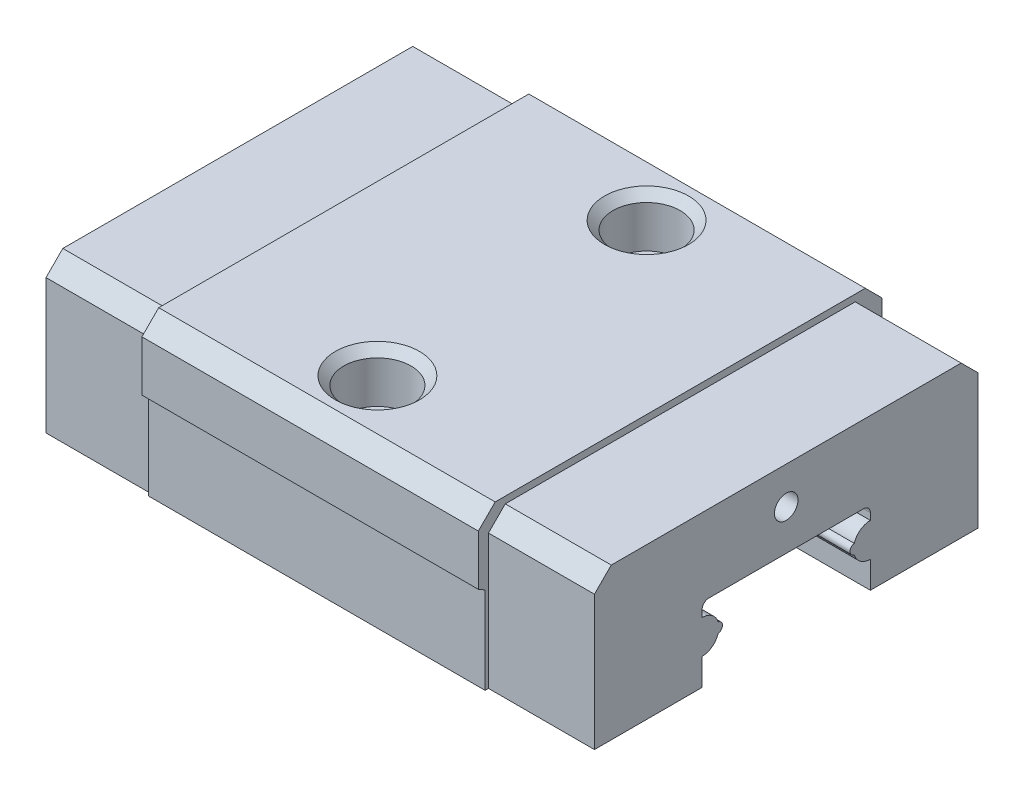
ISO-10303-21;
HEADER;
FILE_DESCRIPTION(('STEP AP214'),'2;1');
FILE_NAME('part.step','',(''),(''),'','','');
FILE_SCHEMA(('AUTOMOTIVE_DESIGN { 1 0 10303 214 1 1 1 1 }'));
ENDSEC;
DATA;
#1=APPLICATION_CONTEXT('core data for automotive mechanical design processes');
#2=APPLICATION_PROTOCOL_DEFINITION('international standard','automotive_design',2000,#1);
#3=PRODUCT_CONTEXT('',#1,'mechanical');
#4=PRODUCT('Part','Part','',(#3));
#5=PRODUCT_RELATED_PRODUCT_CATEGORY('part','',(#4));
#6=PRODUCT_DEFINITION_FORMATION('','',#4);
#7=PRODUCT_DEFINITION_CONTEXT('part definition',#1,'design');
#8=PRODUCT_DEFINITION('design','',#6,#7);
#9=PRODUCT_DEFINITION_SHAPE('','',#8);
#10=(LENGTH_UNIT() NAMED_UNIT(*) SI_UNIT(.MILLI.,.METRE.));
#11=(NAMED_UNIT(*) PLANE_ANGLE_UNIT() SI_UNIT($,.RADIAN.));
#12=(NAMED_UNIT(*) SI_UNIT($,.STERADIAN.) SOLID_ANGLE_UNIT());
#13=UNCERTAINTY_MEASURE_WITH_UNIT(LENGTH_MEASURE(1.E-05),#10,'distance_accuracy_value','');
#14=(GEOMETRIC_REPRESENTATION_CONTEXT(3) GLOBAL_UNCERTAINTY_ASSIGNED_CONTEXT((#13)) GLOBAL_UNIT_ASSIGNED_CONTEXT((#10,
#11,#12)) REPRESENTATION_CONTEXT('',''));
#15=CARTESIAN_POINT('',(0.,0.,0.));
#16=DIRECTION('',(0.,0.,1.));
#17=DIRECTION('',(1.,0.,0.));
#18=AXIS2_PLACEMENT_3D('',#15,#16,#17);
#19=CARTESIAN_POINT('',(-25.,3.5,2.5));
#20=DIRECTION('',(0.,0.,1.));
#21=DIRECTION('',(0.,-1.,0.));
#22=AXIS2_PLACEMENT_3D('',#19,#20,#21);
#23=PLANE('',#22);
#24=DIRECTION('',(0.,1.,0.));
#25=VECTOR('',#24,1.);
#26=CARTESIAN_POINT('',(-23.15,0.499999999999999,2.5));
#27=LINE('',#26,#25);
#28=CARTESIAN_POINT('',(-23.15,1.3,2.5));
#29=VERTEX_POINT('',#28);
#30=CARTESIAN_POINT('',(-23.15,2.09999999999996,2.5));
#31=VERTEX_POINT('',#30);
#32=EDGE_CURVE('E473',#29,#31,#27,.T.);
#33=ORIENTED_EDGE('',*,*,#32,.T.);
#34=DIRECTION('',(1.,0.,0.));
#35=VECTOR('',#34,1.);
#36=CARTESIAN_POINT('',(-23.15,2.09999999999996,2.5));
#37=LINE('',#36,#35);
#38=CARTESIAN_POINT('',(-6.85,2.09999999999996,2.5));
#39=VERTEX_POINT('',#38);
#40=EDGE_CURVE('E286',#31,#39,#37,.T.);
#41=ORIENTED_EDGE('',*,*,#40,.T.);
#42=DIRECTION('',(0.,-1.,0.));
#43=VECTOR('',#42,1.);
#44=CARTESIAN_POINT('',(-6.85,0.499999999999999,2.5));
#45=LINE('',#44,#43);
#46=CARTESIAN_POINT('',(-6.85,1.3,2.5));
#47=VERTEX_POINT('',#46);
#48=EDGE_CURVE('E418',#39,#47,#45,.T.);
#49=ORIENTED_EDGE('',*,*,#48,.T.);
#50=DIRECTION('',(1.,0.,0.));
#51=VECTOR('',#50,1.);
#52=CARTESIAN_POINT('',(-25.,1.3,2.5));
#53=LINE('',#52,#51);
#54=EDGE_CURVE('E539',#29,#47,#53,.T.);
#55=ORIENTED_EDGE('',*,*,#54,.F.);
#56=EDGE_LOOP('',(#33,#41,#49,#55));
#57=FACE_BOUND('',#56,.T.);
#58=ADVANCED_FACE('F39',(#57),#23,.F.);
#59=CARTESIAN_POINT('',(-25.,0.5,-2.5));
#60=DIRECTION('',(0.,0.,-1.));
#61=DIRECTION('',(0.,1.,0.));
#62=AXIS2_PLACEMENT_3D('',#59,#60,#61);
#63=PLANE('',#62);
#64=DIRECTION('',(0.,1.,0.));
#65=VECTOR('',#64,1.);
#66=CARTESIAN_POINT('',(-6.85,0.5,-2.5));
#67=LINE('',#66,#65);
#68=CARTESIAN_POINT('',(-6.85,3.09999999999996,-2.5));
#69=VERTEX_POINT('',#68);
#70=CARTESIAN_POINT('',(-6.85,3.3,-2.5));
#71=VERTEX_POINT('',#70);
#72=EDGE_CURVE('E415',#69,#71,#67,.T.);
#73=ORIENTED_EDGE('',*,*,#72,.T.);
#74=DIRECTION('',(1.,0.,0.));
#75=VECTOR('',#74,1.);
#76=CARTESIAN_POINT('',(-23.15,3.3,-2.5));
#77=LINE('',#76,#75);
#78=CARTESIAN_POINT('',(-23.15,3.3,-2.5));
#79=VERTEX_POINT('',#78);
#80=EDGE_CURVE('E578',#71,#79,#77,.F.);
#81=ORIENTED_EDGE('',*,*,#80,.T.);
#82=DIRECTION('',(0.,-1.,0.));
#83=VECTOR('',#82,1.);
#84=CARTESIAN_POINT('',(-23.15,0.5,-2.5));
#85=LINE('',#84,#83);
#86=CARTESIAN_POINT('',(-23.15,3.09999999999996,-2.5));
#87=VERTEX_POINT('',#86);
#88=EDGE_CURVE('E563',#79,#87,#85,.T.);
#89=ORIENTED_EDGE('',*,*,#88,.T.);
#90=DIRECTION('',(1.,0.,0.));
#91=VECTOR('',#90,1.);
#92=CARTESIAN_POINT('',(-23.15,3.09999999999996,-2.5));
#93=LINE('',#92,#91);
#94=EDGE_CURVE('E567',#87,#69,#93,.T.);
#95=ORIENTED_EDGE('',*,*,#94,.T.);
#96=EDGE_LOOP('',(#73,#81,#89,#95));
#97=FACE_BOUND('',#96,.T.);
#98=ADVANCED_FACE('F665',(#97),#63,.F.);
#99=CARTESIAN_POINT('',(-6.85,5.8,-5.7));
#100=DIRECTION('',(-1.,0.,0.));
#101=DIRECTION('',(0.,0.,-1.));
#102=AXIS2_PLACEMENT_3D('',#99,#100,#101);
#103=PLANE('',#102);
#104=ORIENTED_EDGE('',*,*,#48,.F.);
#105=CARTESIAN_POINT('',(-6.85,2.59999999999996,2.5));
#106=DIRECTION('',(1.,0.,0.));
#107=DIRECTION('',(0.,0.,1.));
#108=AXIS2_PLACEMENT_3D('',#105,#106,#107);
#109=CIRCLE('',#108,0.5);
#110=CARTESIAN_POINT('',(-6.85,2.45174744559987,2.02248436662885));
#111=VERTEX_POINT('',#110);
#112=EDGE_CURVE('E307',#39,#111,#109,.T.);
#113=ORIENTED_EDGE('',*,*,#112,.T.);
#114=CARTESIAN_POINT('',(-6.85,2.59999999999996,2.04531373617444));
#115=DIRECTION('',(1.,0.,0.));
#116=DIRECTION('',(0.,0.,1.));
#117=AXIS2_PLACEMENT_3D('',#114,#115,#116);
#118=CIRCLE('',#117,0.15);
#119=CARTESIAN_POINT('',(-6.85,2.74825255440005,2.02248436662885));
#120=VERTEX_POINT('',#119);
#121=EDGE_CURVE('E290',#111,#120,#118,.T.);
#122=ORIENTED_EDGE('',*,*,#121,.T.);
#123=CARTESIAN_POINT('',(-6.85,3.09999999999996,2.5));
#124=VERTEX_POINT('',#123);
#125=EDGE_CURVE('E304',#120,#124,#109,.T.);
#126=ORIENTED_EDGE('',*,*,#125,.T.);
#127=CARTESIAN_POINT('',(-6.85,3.3,2.5));
#128=VERTEX_POINT('',#127);
#129=EDGE_CURVE('E419',#128,#124,#45,.T.);
#130=ORIENTED_EDGE('',*,*,#129,.F.);
#131=CARTESIAN_POINT('',(-6.85,3.3,2.3));
#132=DIRECTION('',(-1.,0.,0.));
#133=DIRECTION('',(0.,0.,1.));
#134=AXIS2_PLACEMENT_3D('',#131,#132,#133);
#135=CIRCLE('',#134,0.2);
#136=CARTESIAN_POINT('',(-6.85,3.5,2.3));
#137=VERTEX_POINT('',#136);
#138=EDGE_CURVE('E47',#128,#137,#135,.T.);
#139=ORIENTED_EDGE('',*,*,#138,.T.);
#140=DIRECTION('',(0.,0.,1.));
#141=VECTOR('',#140,1.);
#142=CARTESIAN_POINT('',(-6.85,3.5,-2.5));
#143=LINE('',#142,#141);
#144=CARTESIAN_POINT('',(-6.85,3.5,-2.3));
#145=VERTEX_POINT('',#144);
#146=EDGE_CURVE('E412',#145,#137,#143,.T.);
#147=ORIENTED_EDGE('',*,*,#146,.F.);
#148=CARTESIAN_POINT('',(-6.85,3.3,-2.3));
#149=DIRECTION('',(-1.,0.,0.));
#150=DIRECTION('',(0.,0.,1.));
#151=AXIS2_PLACEMENT_3D('',#148,#149,#150);
#152=CIRCLE('',#151,0.2);
#153=EDGE_CURVE('E582',#145,#71,#152,.T.);
#154=ORIENTED_EDGE('',*,*,#153,.T.);
#155=ORIENTED_EDGE('',*,*,#72,.F.);
#156=CARTESIAN_POINT('',(-6.85,2.59999999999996,-2.5));
#157=DIRECTION('',(1.,0.,0.));
#158=DIRECTION('',(0.,0.,-1.));
#159=AXIS2_PLACEMENT_3D('',#156,#157,#158);
#160=CIRCLE('',#159,0.5);
#161=CARTESIAN_POINT('',(-6.85,2.74825255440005,-2.02248436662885));
#162=VERTEX_POINT('',#161);
#163=EDGE_CURVE('E309',#69,#162,#160,.T.);
#164=ORIENTED_EDGE('',*,*,#163,.T.);
#165=CARTESIAN_POINT('',(-6.85,2.59999999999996,-2.04531373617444));
#166=DIRECTION('',(1.,0.,0.));
#167=DIRECTION('',(0.,0.,-1.));
#168=AXIS2_PLACEMENT_3D('',#165,#166,#167);
#169=CIRCLE('',#168,0.15);
#170=CARTESIAN_POINT('',(-6.85,2.45174744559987,-2.02248436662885));
#171=VERTEX_POINT('',#170);
#172=EDGE_CURVE('E322',#162,#171,#169,.T.);
#173=ORIENTED_EDGE('',*,*,#172,.T.);
#174=CARTESIAN_POINT('',(-6.85,2.09999999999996,-2.5));
#175=VERTEX_POINT('',#174);
#176=EDGE_CURVE('E319',#171,#175,#160,.T.);
#177=ORIENTED_EDGE('',*,*,#176,.T.);
#178=CARTESIAN_POINT('',(-6.85,1.3,-2.5));
#179=VERTEX_POINT('',#178);
#180=EDGE_CURVE('E416',#179,#175,#67,.T.);
#181=ORIENTED_EDGE('',*,*,#180,.F.);
#182=DIRECTION('',(0.,0.,1.));
#183=VECTOR('',#182,1.);
#184=CARTESIAN_POINT('',(-6.85,1.3,-5.7));
#185=LINE('',#184,#183);
#186=CARTESIAN_POINT('',(-6.85,1.3,-5.7));
#187=VERTEX_POINT('',#186);
#188=EDGE_CURVE('E383',#187,#179,#185,.T.);
#189=ORIENTED_EDGE('',*,*,#188,.F.);
#190=DIRECTION('',(0.,-1.,0.));
#191=VECTOR('',#190,1.);
#192=CARTESIAN_POINT('',(-6.85,1.3,-5.7));
#193=LINE('',#192,#191);
#194=CARTESIAN_POINT('',(-6.85,5.3,-5.7));
#195=VERTEX_POINT('',#194);
#196=EDGE_CURVE('E366',#195,#187,#193,.T.);
#197=ORIENTED_EDGE('',*,*,#196,.F.);
#198=DIRECTION('',(0.,-0.707106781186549,-0.707106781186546));
#199=VECTOR('',#198,1.);
#200=CARTESIAN_POINT('',(-6.85,5.8,-5.2));
#201=LINE('',#200,#199);
#202=CARTESIAN_POINT('',(-6.85,5.8,-5.2));
#203=VERTEX_POINT('',#202);
#204=EDGE_CURVE('E369',#203,#195,#201,.T.);
#205=ORIENTED_EDGE('',*,*,#204,.F.);
#206=DIRECTION('',(0.,0.,-1.));
#207=VECTOR('',#206,1.);
#208=CARTESIAN_POINT('',(-6.85,5.8,-5.2));
#209=LINE('',#208,#207);
#210=CARTESIAN_POINT('',(-6.85,5.8,5.2));
#211=VERTEX_POINT('',#210);
#212=EDGE_CURVE('E373',#211,#203,#209,.T.);
#213=ORIENTED_EDGE('',*,*,#212,.F.);
#214=DIRECTION('',(0.,0.707106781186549,-0.707106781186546));
#215=VECTOR('',#214,1.);
#216=CARTESIAN_POINT('',(-6.85,5.8,5.2));
#217=LINE('',#216,#215);
#218=CARTESIAN_POINT('',(-6.85,5.3,5.7));
#219=VERTEX_POINT('',#218);
#220=EDGE_CURVE('E376',#219,#211,#217,.T.);
#221=ORIENTED_EDGE('',*,*,#220,.F.);
#222=DIRECTION('',(0.,1.,0.));
#223=VECTOR('',#222,1.);
#224=CARTESIAN_POINT('',(-6.85,1.3,5.7));
#225=LINE('',#224,#223);
#226=CARTESIAN_POINT('',(-6.85,1.3,5.7));
#227=VERTEX_POINT('',#226);
#228=EDGE_CURVE('E379',#227,#219,#225,.T.);
#229=ORIENTED_EDGE('',*,*,#228,.F.);
#230=EDGE_CURVE('E382',#47,#227,#185,.T.);
#231=ORIENTED_EDGE('',*,*,#230,.F.);
#232=EDGE_LOOP('',(#104,#113,#122,#126,#130,#139,#147,#154,#155,#164,#173,#177,#181,#189,#197,
#205,#213,#221,#229,#231));
#233=FACE_BOUND('',#232,.T.);
#234=CARTESIAN_POINT('',(-6.85,4.7,0.));
#235=DIRECTION('',(-1.,0.,0.));
#236=DIRECTION('',(0.,0.,1.));
#237=AXIS2_PLACEMENT_3D('',#234,#235,#236);
#238=CIRCLE('',#237,0.35);
#239=CARTESIAN_POINT('',(-6.85,4.7,0.35));
#240=VERTEX_POINT('',#239);
#241=EDGE_CURVE('E359',#240,#240,#238,.T.);
#242=ORIENTED_EDGE('',*,*,#241,.T.);
#243=EDGE_LOOP('',(#242));
#244=FACE_BOUND('',#243,.T.);
#245=ADVANCED_FACE('F588',(#233,#244),#103,.F.);
#246=CARTESIAN_POINT('',(-20.,1.3,-5.8));
#247=DIRECTION('',(-1.,0.,0.));
#248=DIRECTION('',(0.,0.,1.));
#249=AXIS2_PLACEMENT_3D('',#246,#247,#248);
#250=PLANE('',#249);
#251=DIRECTION('',(0.,0.,-1.));
#252=VECTOR('',#251,1.);
#253=CARTESIAN_POINT('',(-20.,1.3,5.8));
#254=LINE('',#253,#252);
#255=CARTESIAN_POINT('',(-20.,1.3,-5.7));
#256=VERTEX_POINT('',#255);
#257=CARTESIAN_POINT('',(-20.,1.3,-5.8));
#258=VERTEX_POINT('',#257);
#259=EDGE_CURVE('E531',#256,#258,#254,.T.);
#260=ORIENTED_EDGE('',*,*,#259,.F.);
#261=DIRECTION('',(0.,-1.,0.));
#262=VECTOR('',#261,1.);
#263=CARTESIAN_POINT('',(-20.,1.3,-5.7));
#264=LINE('',#263,#262);
#265=CARTESIAN_POINT('',(-20.,5.3,-5.7));
#266=VERTEX_POINT('',#265);
#267=EDGE_CURVE('E425',#266,#256,#264,.T.);
#268=ORIENTED_EDGE('',*,*,#267,.F.);
#269=DIRECTION('',(0.,-0.707106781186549,-0.707106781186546));
#270=VECTOR('',#269,1.);
#271=CARTESIAN_POINT('',(-20.,5.8,-5.2));
#272=LINE('',#271,#270);
#273=CARTESIAN_POINT('',(-20.,5.8,-5.2));
#274=VERTEX_POINT('',#273);
#275=EDGE_CURVE('E432',#274,#266,#272,.T.);
#276=ORIENTED_EDGE('',*,*,#275,.F.);
#277=DIRECTION('',(0.,0.,-1.));
#278=VECTOR('',#277,1.);
#279=CARTESIAN_POINT('',(-20.,5.8,-5.2));
#280=LINE('',#279,#278);
#281=CARTESIAN_POINT('',(-20.,5.8,5.2));
#282=VERTEX_POINT('',#281);
#283=EDGE_CURVE('E451',#282,#274,#280,.T.);
#284=ORIENTED_EDGE('',*,*,#283,.F.);
#285=DIRECTION('',(0.,0.707106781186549,-0.707106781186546));
#286=VECTOR('',#285,1.);
#287=CARTESIAN_POINT('',(-20.,5.8,5.2));
#288=LINE('',#287,#286);
#289=CARTESIAN_POINT('',(-20.,5.3,5.7));
#290=VERTEX_POINT('',#289);
#291=EDGE_CURVE('E449',#290,#282,#288,.T.);
#292=ORIENTED_EDGE('',*,*,#291,.F.);
#293=DIRECTION('',(0.,1.,0.));
#294=VECTOR('',#293,1.);
#295=CARTESIAN_POINT('',(-20.,1.3,5.7));
#296=LINE('',#295,#294);
#297=CARTESIAN_POINT('',(-20.,1.3,5.7));
#298=VERTEX_POINT('',#297);
#299=EDGE_CURVE('E447',#298,#290,#296,.T.);
#300=ORIENTED_EDGE('',*,*,#299,.F.);
#301=CARTESIAN_POINT('',(-20.,1.3,5.8));
#302=VERTEX_POINT('',#301);
#303=EDGE_CURVE('E532',#302,#298,#254,.T.);
#304=ORIENTED_EDGE('',*,*,#303,.F.);
#305=DIRECTION('',(0.,-1.,0.));
#306=VECTOR('',#305,1.);
#307=CARTESIAN_POINT('',(-20.,1.3,5.8));
#308=LINE('',#307,#306);
#309=CARTESIAN_POINT('',(-20.,3.88452994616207,5.8));
#310=VERTEX_POINT('',#309);
#311=EDGE_CURVE('E528',#310,#302,#308,.T.);
#312=ORIENTED_EDGE('',*,*,#311,.F.);
#313=DIRECTION('',(0.,-0.500000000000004,-0.866025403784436));
#314=VECTOR('',#313,1.);
#315=CARTESIAN_POINT('',(-20.,4.,6.));
#316=LINE('',#315,#314);
#317=CARTESIAN_POINT('',(-20.,4.,6.));
#318=VERTEX_POINT('',#317);
#319=EDGE_CURVE('E525',#318,#310,#316,.T.);
#320=ORIENTED_EDGE('',*,*,#319,.F.);
#321=DIRECTION('',(0.,-1.,0.));
#322=VECTOR('',#321,1.);
#323=CARTESIAN_POINT('',(-20.,5.50000000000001,6.));
#324=LINE('',#323,#322);
#325=CARTESIAN_POINT('',(-20.,5.50000000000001,6.));
#326=VERTEX_POINT('',#325);
#327=EDGE_CURVE('E522',#326,#318,#324,.T.);
#328=ORIENTED_EDGE('',*,*,#327,.F.);
#329=DIRECTION('',(0.,-0.707106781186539,0.707106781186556));
#330=VECTOR('',#329,1.);
#331=CARTESIAN_POINT('',(-20.,6.,5.5));
#332=LINE('',#331,#330);
#333=CARTESIAN_POINT('',(-20.,6.,5.5));
#334=VERTEX_POINT('',#333);
#335=EDGE_CURVE('E519',#334,#326,#332,.T.);
#336=ORIENTED_EDGE('',*,*,#335,.F.);
#337=DIRECTION('',(0.,0.,1.));
#338=VECTOR('',#337,1.);
#339=CARTESIAN_POINT('',(-20.,6.,2.5));
#340=LINE('',#339,#338);
#341=CARTESIAN_POINT('',(-20.,6.,-5.5));
#342=VERTEX_POINT('',#341);
#343=EDGE_CURVE('E517',#342,#334,#340,.T.);
#344=ORIENTED_EDGE('',*,*,#343,.F.);
#345=DIRECTION('',(0.,0.707106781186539,0.707106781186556));
#346=VECTOR('',#345,1.);
#347=CARTESIAN_POINT('',(-20.,6.,-5.5));
#348=LINE('',#347,#346);
#349=CARTESIAN_POINT('',(-20.,5.50000000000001,-6.));
#350=VERTEX_POINT('',#349);
#351=EDGE_CURVE('E514',#350,#342,#348,.T.);
#352=ORIENTED_EDGE('',*,*,#351,.F.);
#353=DIRECTION('',(0.,1.,0.));
#354=VECTOR('',#353,1.);
#355=CARTESIAN_POINT('',(-20.,5.50000000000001,-6.));
#356=LINE('',#355,#354);
#357=CARTESIAN_POINT('',(-20.,4.,-6.));
#358=VERTEX_POINT('',#357);
#359=EDGE_CURVE('E511',#358,#350,#356,.T.);
#360=ORIENTED_EDGE('',*,*,#359,.F.);
#361=DIRECTION('',(0.,0.500000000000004,-0.866025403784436));
#362=VECTOR('',#361,1.);
#363=CARTESIAN_POINT('',(-20.,4.,-6.));
#364=LINE('',#363,#362);
#365=CARTESIAN_POINT('',(-20.,3.88452994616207,-5.8));
#366=VERTEX_POINT('',#365);
#367=EDGE_CURVE('E508',#366,#358,#364,.T.);
#368=ORIENTED_EDGE('',*,*,#367,.F.);
#369=DIRECTION('',(0.,1.,0.));
#370=VECTOR('',#369,1.);
#371=CARTESIAN_POINT('',(-20.,1.3,-5.8));
#372=LINE('',#371,#370);
#373=EDGE_CURVE('E505',#258,#366,#372,.T.);
#374=ORIENTED_EDGE('',*,*,#373,.F.);
#375=EDGE_LOOP('',(#260,#268,#276,#284,#292,#300,#304,#312,#320,#328,#336,#344,#352,#360,#368,#374));
#376=FACE_BOUND('',#375,.T.);
#377=ADVANCED_FACE('F672',(#376),#250,.T.);
#378=CARTESIAN_POINT('',(-20.,1.3,5.8));
#379=DIRECTION('',(0.,-1.,0.));
#380=DIRECTION('',(0.,0.,-1.));
#381=AXIS2_PLACEMENT_3D('',#378,#379,#380);
#382=PLANE('',#381);
#383=ORIENTED_EDGE('',*,*,#303,.T.);
#384=DIRECTION('',(1.,0.,0.));
#385=VECTOR('',#384,1.);
#386=CARTESIAN_POINT('',(-23.15,1.3,5.7));
#387=LINE('',#386,#385);
#388=CARTESIAN_POINT('',(-23.15,1.3,5.7));
#389=VERTEX_POINT('',#388);
#390=EDGE_CURVE('E465',#389,#298,#387,.T.);
#391=ORIENTED_EDGE('',*,*,#390,.F.);
#392=DIRECTION('',(0.,0.,1.));
#393=VECTOR('',#392,1.);
#394=CARTESIAN_POINT('',(-23.15,1.3,-5.7));
#395=LINE('',#394,#393);
#396=EDGE_CURVE('E431',#29,#389,#395,.T.);
#397=ORIENTED_EDGE('',*,*,#396,.F.);
#398=ORIENTED_EDGE('',*,*,#54,.T.);
#399=ORIENTED_EDGE('',*,*,#230,.T.);
#400=DIRECTION('',(-1.,0.,0.));
#401=VECTOR('',#400,1.);
#402=CARTESIAN_POINT('',(-6.85,1.3,5.7));
#403=LINE('',#402,#401);
#404=CARTESIAN_POINT('',(-10.,1.3,5.7));
#405=VERTEX_POINT('',#404);
#406=EDGE_CURVE('E397',#227,#405,#403,.T.);
#407=ORIENTED_EDGE('',*,*,#406,.T.);
#408=DIRECTION('',(0.,0.,-1.));
#409=VECTOR('',#408,1.);
#410=CARTESIAN_POINT('',(-10.,1.3,5.8));
#411=LINE('',#410,#409);
#412=CARTESIAN_POINT('',(-10.,1.3,5.8));
#413=VERTEX_POINT('',#412);
#414=EDGE_CURVE('E503',#413,#405,#411,.T.);
#415=ORIENTED_EDGE('',*,*,#414,.F.);
#416=DIRECTION('',(1.,0.,0.));
#417=VECTOR('',#416,1.);
#418=CARTESIAN_POINT('',(-20.,1.3,5.8));
#419=LINE('',#418,#417);
#420=EDGE_CURVE('E540',#302,#413,#419,.T.);
#421=ORIENTED_EDGE('',*,*,#420,.F.);
#422=EDGE_LOOP('',(#383,#391,#397,#398,#399,#407,#415,#421));
#423=FACE_BOUND('',#422,.T.);
#424=ADVANCED_FACE('F605',(#423),#382,.T.);
#425=CARTESIAN_POINT('',(-20.,1.3,-5.8));
#426=DIRECTION('',(0.,0.,-1.));
#427=DIRECTION('',(-1.,0.,0.));
#428=AXIS2_PLACEMENT_3D('',#425,#426,#427);
#429=PLANE('',#428);
#430=DIRECTION('',(1.,0.,0.));
#431=VECTOR('',#430,1.);
#432=CARTESIAN_POINT('',(-20.,3.88452994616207,-5.8));
#433=LINE('',#432,#431);
#434=CARTESIAN_POINT('',(-10.,3.88452994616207,-5.8));
#435=VERTEX_POINT('',#434);
#436=EDGE_CURVE('E535',#366,#435,#433,.T.);
#437=ORIENTED_EDGE('',*,*,#436,.T.);
#438=DIRECTION('',(0.,1.,0.));
#439=VECTOR('',#438,1.);
#440=CARTESIAN_POINT('',(-10.,1.3,-5.8));
#441=LINE('',#440,#439);
#442=CARTESIAN_POINT('',(-10.,1.3,-5.8));
#443=VERTEX_POINT('',#442);
#444=EDGE_CURVE('E475',#443,#435,#441,.T.);
#445=ORIENTED_EDGE('',*,*,#444,.F.);
#446=DIRECTION('',(1.,0.,0.));
#447=VECTOR('',#446,1.);
#448=CARTESIAN_POINT('',(-20.,1.3,-5.8));
#449=LINE('',#448,#447);
#450=EDGE_CURVE('E536',#258,#443,#449,.T.);
#451=ORIENTED_EDGE('',*,*,#450,.F.);
#452=ORIENTED_EDGE('',*,*,#373,.T.);
#453=EDGE_LOOP('',(#437,#445,#451,#452));
#454=FACE_BOUND('',#453,.T.);
#455=ADVANCED_FACE('F785',(#454),#429,.T.);
#456=CARTESIAN_POINT('',(-10.,1.3,-5.7));
#457=VERTEX_POINT('',#456);
#458=EDGE_CURVE('E502',#457,#443,#411,.T.);
#459=ORIENTED_EDGE('',*,*,#458,.F.);
#460=DIRECTION('',(-1.,0.,0.));
#461=VECTOR('',#460,1.);
#462=CARTESIAN_POINT('',(-6.85,1.3,-5.7));
#463=LINE('',#462,#461);
#464=EDGE_CURVE('E386',#187,#457,#463,.T.);
#465=ORIENTED_EDGE('',*,*,#464,.F.);
#466=ORIENTED_EDGE('',*,*,#188,.T.);
#467=DIRECTION('',(-1.,0.,0.));
#468=VECTOR('',#467,1.);
#469=CARTESIAN_POINT('',(-25.,1.3,-2.5));
#470=LINE('',#469,#468);
#471=CARTESIAN_POINT('',(-23.15,1.3,-2.5));
#472=VERTEX_POINT('',#471);
#473=EDGE_CURVE('E559',#179,#472,#470,.T.);
#474=ORIENTED_EDGE('',*,*,#473,.T.);
#475=CARTESIAN_POINT('',(-23.15,1.3,-5.7));
#476=VERTEX_POINT('',#475);
#477=EDGE_CURVE('E433',#476,#472,#395,.T.);
#478=ORIENTED_EDGE('',*,*,#477,.F.);
#479=DIRECTION('',(1.,0.,0.));
#480=VECTOR('',#479,1.);
#481=CARTESIAN_POINT('',(-23.15,1.3,-5.7));
#482=LINE('',#481,#480);
#483=EDGE_CURVE('E467',#476,#256,#482,.T.);
#484=ORIENTED_EDGE('',*,*,#483,.T.);
#485=ORIENTED_EDGE('',*,*,#259,.T.);
#486=ORIENTED_EDGE('',*,*,#450,.T.);
#487=EDGE_LOOP('',(#459,#465,#466,#474,#478,#484,#485,#486));
#488=FACE_BOUND('',#487,.T.);
#489=ADVANCED_FACE('F636',(#488),#382,.T.);
#490=CARTESIAN_POINT('',(-20.,1.3,5.8));
#491=DIRECTION('',(0.,0.,1.));
#492=DIRECTION('',(1.,0.,0.));
#493=AXIS2_PLACEMENT_3D('',#490,#491,#492);
#494=PLANE('',#493);
#495=ORIENTED_EDGE('',*,*,#420,.T.);
#496=DIRECTION('',(0.,-1.,0.));
#497=VECTOR('',#496,1.);
#498=CARTESIAN_POINT('',(-10.,1.3,5.8));
#499=LINE('',#498,#497);
#500=CARTESIAN_POINT('',(-10.,3.88452994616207,5.8));
#501=VERTEX_POINT('',#500);
#502=EDGE_CURVE('E499',#501,#413,#499,.T.);
#503=ORIENTED_EDGE('',*,*,#502,.F.);
#504=DIRECTION('',(1.,0.,0.));
#505=VECTOR('',#504,1.);
#506=CARTESIAN_POINT('',(-20.,3.88452994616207,5.8));
#507=LINE('',#506,#505);
#508=EDGE_CURVE('E542',#310,#501,#507,.T.);
#509=ORIENTED_EDGE('',*,*,#508,.F.);
#510=ORIENTED_EDGE('',*,*,#311,.T.);
#511=EDGE_LOOP('',(#495,#503,#509,#510));
#512=FACE_BOUND('',#511,.T.);
#513=ADVANCED_FACE('F784',(#512),#494,.T.);
#514=CARTESIAN_POINT('',(-20.,4.,6.));
#515=DIRECTION('',(0.,-0.866025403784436,0.500000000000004));
#516=DIRECTION('',(0.,-0.500000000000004,-0.866025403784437));
#517=AXIS2_PLACEMENT_3D('',#514,#515,#516);
#518=PLANE('',#517);
#519=ORIENTED_EDGE('',*,*,#508,.T.);
#520=DIRECTION('',(0.,-0.500000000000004,-0.866025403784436));
#521=VECTOR('',#520,1.);
#522=CARTESIAN_POINT('',(-10.,4.,6.));
#523=LINE('',#522,#521);
#524=CARTESIAN_POINT('',(-10.,4.,6.));
#525=VERTEX_POINT('',#524);
#526=EDGE_CURVE('E496',#525,#501,#523,.T.);
#527=ORIENTED_EDGE('',*,*,#526,.F.);
#528=DIRECTION('',(1.,0.,0.));
#529=VECTOR('',#528,1.);
#530=CARTESIAN_POINT('',(-20.,4.,6.));
#531=LINE('',#530,#529);
#532=EDGE_CURVE('E544',#318,#525,#531,.T.);
#533=ORIENTED_EDGE('',*,*,#532,.F.);
#534=ORIENTED_EDGE('',*,*,#319,.T.);
#535=EDGE_LOOP('',(#519,#527,#533,#534));
#536=FACE_BOUND('',#535,.T.);
#537=ADVANCED_FACE('F788',(#536),#518,.T.);
#538=CARTESIAN_POINT('',(-20.,5.50000000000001,6.));
#539=DIRECTION('',(0.,0.,1.));
#540=DIRECTION('',(1.,0.,0.));
#541=AXIS2_PLACEMENT_3D('',#538,#539,#540);
#542=PLANE('',#541);
#543=ORIENTED_EDGE('',*,*,#532,.T.);
#544=DIRECTION('',(0.,-1.,0.));
#545=VECTOR('',#544,1.);
#546=CARTESIAN_POINT('',(-10.,5.50000000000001,6.));
#547=LINE('',#546,#545);
#548=CARTESIAN_POINT('',(-10.,5.50000000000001,6.));
#549=VERTEX_POINT('',#548);
#550=EDGE_CURVE('E493',#549,#525,#547,.T.);
#551=ORIENTED_EDGE('',*,*,#550,.F.);
#552=DIRECTION('',(1.,0.,0.));
#553=VECTOR('',#552,1.);
#554=CARTESIAN_POINT('',(-20.,5.50000000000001,6.));
#555=LINE('',#554,#553);
#556=EDGE_CURVE('E546',#326,#549,#555,.T.);
#557=ORIENTED_EDGE('',*,*,#556,.F.);
#558=ORIENTED_EDGE('',*,*,#327,.T.);
#559=EDGE_LOOP('',(#543,#551,#557,#558));
#560=FACE_BOUND('',#559,.T.);
#561=ADVANCED_FACE('F792',(#560),#542,.T.);
#562=CARTESIAN_POINT('',(-20.,6.,5.5));
#563=DIRECTION('',(0.,0.707106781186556,0.707106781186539));
#564=DIRECTION('',(0.,-0.707106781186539,0.707106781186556));
#565=AXIS2_PLACEMENT_3D('',#562,#563,#564);
#566=PLANE('',#565);
#567=ORIENTED_EDGE('',*,*,#556,.T.);
#568=DIRECTION('',(0.,-0.707106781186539,0.707106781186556));
#569=VECTOR('',#568,1.);
#570=CARTESIAN_POINT('',(-10.,6.,5.5));
#571=LINE('',#570,#569);
#572=CARTESIAN_POINT('',(-10.,6.,5.5));
#573=VERTEX_POINT('',#572);
#574=EDGE_CURVE('E490',#573,#549,#571,.T.);
#575=ORIENTED_EDGE('',*,*,#574,.F.);
#576=DIRECTION('',(1.,0.,0.));
#577=VECTOR('',#576,1.);
#578=CARTESIAN_POINT('',(-20.,6.,5.5));
#579=LINE('',#578,#577);
#580=EDGE_CURVE('E548',#334,#573,#579,.T.);
#581=ORIENTED_EDGE('',*,*,#580,.F.);
#582=ORIENTED_EDGE('',*,*,#335,.T.);
#583=EDGE_LOOP('',(#567,#575,#581,#582));
#584=FACE_BOUND('',#583,.T.);
#585=ADVANCED_FACE('F796',(#584),#566,.T.);
#586=CARTESIAN_POINT('',(-20.,6.,5.5));
#587=DIRECTION('',(0.,1.,0.));
#588=DIRECTION('',(0.,0.,1.));
#589=AXIS2_PLACEMENT_3D('',#586,#587,#588);
#590=PLANE('',#589);
#591=CARTESIAN_POINT('',(-15.,6.,-4.00000000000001));
#592=DIRECTION('',(0.,1.,0.));
#593=DIRECTION('',(0.,0.,1.));
#594=AXIS2_PLACEMENT_3D('',#591,#592,#593);
#595=CIRCLE('',#594,1.25);
#596=CARTESIAN_POINT('',(-15.,6.,-2.75000000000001));
#597=VERTEX_POINT('',#596);
#598=EDGE_CURVE('E341',#597,#597,#595,.T.);
#599=ORIENTED_EDGE('',*,*,#598,.F.);
#600=EDGE_LOOP('',(#599));
#601=FACE_BOUND('',#600,.T.);
#602=CARTESIAN_POINT('',(-15.,6.,3.99999999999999));
#603=DIRECTION('',(0.,1.,0.));
#604=DIRECTION('',(0.,0.,1.));
#605=AXIS2_PLACEMENT_3D('',#602,#603,#604);
#606=CIRCLE('',#605,1.25);
#607=CARTESIAN_POINT('',(-15.,6.,5.24999999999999));
#608=VERTEX_POINT('',#607);
#609=EDGE_CURVE('E356',#608,#608,#606,.T.);
#610=ORIENTED_EDGE('',*,*,#609,.F.);
#611=EDGE_LOOP('',(#610));
#612=FACE_BOUND('',#611,.T.);
#613=ORIENTED_EDGE('',*,*,#580,.T.);
#614=DIRECTION('',(0.,0.,1.));
#615=VECTOR('',#614,1.);
#616=CARTESIAN_POINT('',(-10.,6.,2.5));
#617=LINE('',#616,#615);
#618=CARTESIAN_POINT('',(-10.,6.,-5.5));
#619=VERTEX_POINT('',#618);
#620=EDGE_CURVE('E487',#619,#573,#617,.T.);
#621=ORIENTED_EDGE('',*,*,#620,.F.);
#622=DIRECTION('',(1.,0.,0.));
#623=VECTOR('',#622,1.);
#624=CARTESIAN_POINT('',(-20.,6.,-5.5));
#625=LINE('',#624,#623);
#626=EDGE_CURVE('E550',#342,#619,#625,.T.);
#627=ORIENTED_EDGE('',*,*,#626,.F.);
#628=ORIENTED_EDGE('',*,*,#343,.T.);
#629=EDGE_LOOP('',(#613,#621,#627,#628));
#630=FACE_BOUND('',#629,.T.);
#631=ADVANCED_FACE('F800',(#601,#612,#630),#590,.T.);
#632=CARTESIAN_POINT('',(-20.,6.,-5.5));
#633=DIRECTION('',(0.,0.707106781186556,-0.707106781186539));
#634=DIRECTION('',(0.,0.707106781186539,0.707106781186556));
#635=AXIS2_PLACEMENT_3D('',#632,#633,#634);
#636=PLANE('',#635);
#637=ORIENTED_EDGE('',*,*,#626,.T.);
#638=DIRECTION('',(0.,0.707106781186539,0.707106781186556));
#639=VECTOR('',#638,1.);
#640=CARTESIAN_POINT('',(-10.,6.,-5.5));
#641=LINE('',#640,#639);
#642=CARTESIAN_POINT('',(-10.,5.50000000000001,-6.));
#643=VERTEX_POINT('',#642);
#644=EDGE_CURVE('E484',#643,#619,#641,.T.);
#645=ORIENTED_EDGE('',*,*,#644,.F.);
#646=DIRECTION('',(1.,0.,0.));
#647=VECTOR('',#646,1.);
#648=CARTESIAN_POINT('',(-20.,5.50000000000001,-6.));
#649=LINE('',#648,#647);
#650=EDGE_CURVE('E552',#350,#643,#649,.T.);
#651=ORIENTED_EDGE('',*,*,#650,.F.);
#652=ORIENTED_EDGE('',*,*,#351,.T.);
#653=EDGE_LOOP('',(#637,#645,#651,#652));
#654=FACE_BOUND('',#653,.T.);
#655=ADVANCED_FACE('F804',(#654),#636,.T.);
#656=CARTESIAN_POINT('',(-20.,5.50000000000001,-6.));
#657=DIRECTION('',(0.,0.,-1.));
#658=DIRECTION('',(-1.,0.,0.));
#659=AXIS2_PLACEMENT_3D('',#656,#657,#658);
#660=PLANE('',#659);
#661=ORIENTED_EDGE('',*,*,#650,.T.);
#662=DIRECTION('',(0.,1.,0.));
#663=VECTOR('',#662,1.);
#664=CARTESIAN_POINT('',(-10.,5.50000000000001,-6.));
#665=LINE('',#664,#663);
#666=CARTESIAN_POINT('',(-10.,4.,-6.));
#667=VERTEX_POINT('',#666);
#668=EDGE_CURVE('E481',#667,#643,#665,.T.);
#669=ORIENTED_EDGE('',*,*,#668,.F.);
#670=DIRECTION('',(1.,0.,0.));
#671=VECTOR('',#670,1.);
#672=CARTESIAN_POINT('',(-20.,4.,-6.));
#673=LINE('',#672,#671);
#674=EDGE_CURVE('E554',#358,#667,#673,.T.);
#675=ORIENTED_EDGE('',*,*,#674,.F.);
#676=ORIENTED_EDGE('',*,*,#359,.T.);
#677=EDGE_LOOP('',(#661,#669,#675,#676));
#678=FACE_BOUND('',#677,.T.);
#679=ADVANCED_FACE('F808',(#678),#660,.T.);
#680=CARTESIAN_POINT('',(-20.,4.,-6.));
#681=DIRECTION('',(0.,-0.866025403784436,-0.500000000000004));
#682=DIRECTION('',(0.,0.500000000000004,-0.866025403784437));
#683=AXIS2_PLACEMENT_3D('',#680,#681,#682);
#684=PLANE('',#683);
#685=ORIENTED_EDGE('',*,*,#674,.T.);
#686=DIRECTION('',(0.,0.500000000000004,-0.866025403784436));
#687=VECTOR('',#686,1.);
#688=CARTESIAN_POINT('',(-10.,4.,-6.));
#689=LINE('',#688,#687);
#690=EDGE_CURVE('E478',#435,#667,#689,.T.);
#691=ORIENTED_EDGE('',*,*,#690,.F.);
#692=ORIENTED_EDGE('',*,*,#436,.F.);
#693=ORIENTED_EDGE('',*,*,#367,.T.);
#694=EDGE_LOOP('',(#685,#691,#692,#693));
#695=FACE_BOUND('',#694,.T.);
#696=ADVANCED_FACE('F777',(#695),#684,.T.);
#697=CARTESIAN_POINT('',(-10.,1.3,-5.8));
#698=DIRECTION('',(-1.,0.,0.));
#699=DIRECTION('',(0.,0.,1.));
#700=AXIS2_PLACEMENT_3D('',#697,#698,#699);
#701=PLANE('',#700);
#702=DIRECTION('',(0.,-0.707106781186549,-0.707106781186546));
#703=VECTOR('',#702,1.);
#704=CARTESIAN_POINT('',(-10.,5.8,-5.2));
#705=LINE('',#704,#703);
#706=CARTESIAN_POINT('',(-10.,5.8,-5.2));
#707=VERTEX_POINT('',#706);
#708=CARTESIAN_POINT('',(-10.,5.3,-5.7));
#709=VERTEX_POINT('',#708);
#710=EDGE_CURVE('E388',#707,#709,#705,.T.);
#711=ORIENTED_EDGE('',*,*,#710,.T.);
#712=DIRECTION('',(0.,-1.,0.));
#713=VECTOR('',#712,1.);
#714=CARTESIAN_POINT('',(-10.,1.3,-5.7));
#715=LINE('',#714,#713);
#716=EDGE_CURVE('E363',#709,#457,#715,.T.);
#717=ORIENTED_EDGE('',*,*,#716,.T.);
#718=ORIENTED_EDGE('',*,*,#458,.T.);
#719=ORIENTED_EDGE('',*,*,#444,.T.);
#720=ORIENTED_EDGE('',*,*,#690,.T.);
#721=ORIENTED_EDGE('',*,*,#668,.T.);
#722=ORIENTED_EDGE('',*,*,#644,.T.);
#723=ORIENTED_EDGE('',*,*,#620,.T.);
#724=ORIENTED_EDGE('',*,*,#574,.T.);
#725=ORIENTED_EDGE('',*,*,#550,.T.);
#726=ORIENTED_EDGE('',*,*,#526,.T.);
#727=ORIENTED_EDGE('',*,*,#502,.T.);
#728=ORIENTED_EDGE('',*,*,#414,.T.);
#729=DIRECTION('',(0.,1.,0.));
#730=VECTOR('',#729,1.);
#731=CARTESIAN_POINT('',(-10.,1.3,5.7));
#732=LINE('',#731,#730);
#733=CARTESIAN_POINT('',(-10.,5.3,5.7));
#734=VERTEX_POINT('',#733);
#735=EDGE_CURVE('E370',#405,#734,#732,.T.);
#736=ORIENTED_EDGE('',*,*,#735,.T.);
#737=DIRECTION('',(0.,0.707106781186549,-0.707106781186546));
#738=VECTOR('',#737,1.);
#739=CARTESIAN_POINT('',(-10.,5.8,5.2));
#740=LINE('',#739,#738);
#741=CARTESIAN_POINT('',(-10.,5.8,5.2));
#742=VERTEX_POINT('',#741);
#743=EDGE_CURVE('E392',#734,#742,#740,.T.);
#744=ORIENTED_EDGE('',*,*,#743,.T.);
#745=DIRECTION('',(0.,0.,-1.));
#746=VECTOR('',#745,1.);
#747=CARTESIAN_POINT('',(-10.,5.8,-5.2));
#748=LINE('',#747,#746);
#749=EDGE_CURVE('E390',#742,#707,#748,.T.);
#750=ORIENTED_EDGE('',*,*,#749,.T.);
#751=EDGE_LOOP('',(#711,#717,#718,#719,#720,#721,#722,#723,#724,#725,#726,#727,#728,#736,#744,#750));
#752=FACE_BOUND('',#751,.T.);
#753=ADVANCED_FACE('F774',(#752),#701,.F.);
#754=CARTESIAN_POINT('',(-23.15,1.3,-5.7));
#755=DIRECTION('',(0.,0.,1.));
#756=DIRECTION('',(1.,0.,0.));
#757=AXIS2_PLACEMENT_3D('',#754,#755,#756);
#758=PLANE('',#757);
#759=ORIENTED_EDGE('',*,*,#267,.T.);
#760=ORIENTED_EDGE('',*,*,#483,.F.);
#761=DIRECTION('',(0.,-1.,0.));
#762=VECTOR('',#761,1.);
#763=CARTESIAN_POINT('',(-23.15,1.3,-5.7));
#764=LINE('',#763,#762);
#765=CARTESIAN_POINT('',(-23.15,5.3,-5.7));
#766=VERTEX_POINT('',#765);
#767=EDGE_CURVE('E428',#766,#476,#764,.T.);
#768=ORIENTED_EDGE('',*,*,#767,.F.);
#769=DIRECTION('',(1.,0.,0.));
#770=VECTOR('',#769,1.);
#771=CARTESIAN_POINT('',(-23.15,5.3,-5.7));
#772=LINE('',#771,#770);
#773=EDGE_CURVE('E444',#766,#266,#772,.T.);
#774=ORIENTED_EDGE('',*,*,#773,.T.);
#775=EDGE_LOOP('',(#759,#760,#768,#774));
#776=FACE_BOUND('',#775,.T.);
#777=ADVANCED_FACE('F631',(#776),#758,.F.);
#778=CARTESIAN_POINT('',(-23.15,1.3,5.7));
#779=DIRECTION('',(0.,0.,-1.));
#780=DIRECTION('',(-1.,0.,0.));
#781=AXIS2_PLACEMENT_3D('',#778,#779,#780);
#782=PLANE('',#781);
#783=ORIENTED_EDGE('',*,*,#299,.T.);
#784=DIRECTION('',(1.,0.,0.));
#785=VECTOR('',#784,1.);
#786=CARTESIAN_POINT('',(-23.15,5.3,5.7));
#787=LINE('',#786,#785);
#788=CARTESIAN_POINT('',(-23.15,5.3,5.7));
#789=VERTEX_POINT('',#788);
#790=EDGE_CURVE('E462',#789,#290,#787,.T.);
#791=ORIENTED_EDGE('',*,*,#790,.F.);
#792=DIRECTION('',(0.,1.,0.));
#793=VECTOR('',#792,1.);
#794=CARTESIAN_POINT('',(-23.15,1.3,5.7));
#795=LINE('',#794,#793);
#796=EDGE_CURVE('E436',#389,#789,#795,.T.);
#797=ORIENTED_EDGE('',*,*,#796,.F.);
#798=ORIENTED_EDGE('',*,*,#390,.T.);
#799=EDGE_LOOP('',(#783,#791,#797,#798));
#800=FACE_BOUND('',#799,.T.);
#801=ADVANCED_FACE('F611',(#800),#782,.F.);
#802=CARTESIAN_POINT('',(-23.15,5.8,5.2));
#803=DIRECTION('',(0.,-0.707106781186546,-0.707106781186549));
#804=DIRECTION('',(0.,0.707106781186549,-0.707106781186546));
#805=AXIS2_PLACEMENT_3D('',#802,#803,#804);
#806=PLANE('',#805);
#807=ORIENTED_EDGE('',*,*,#291,.T.);
#808=DIRECTION('',(1.,0.,0.));
#809=VECTOR('',#808,1.);
#810=CARTESIAN_POINT('',(-23.15,5.8,5.2));
#811=LINE('',#810,#809);
#812=CARTESIAN_POINT('',(-23.15,5.8,5.2));
#813=VERTEX_POINT('',#812);
#814=EDGE_CURVE('E459',#813,#282,#811,.T.);
#815=ORIENTED_EDGE('',*,*,#814,.F.);
#816=DIRECTION('',(0.,0.707106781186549,-0.707106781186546));
#817=VECTOR('',#816,1.);
#818=CARTESIAN_POINT('',(-23.15,5.8,5.2));
#819=LINE('',#818,#817);
#820=EDGE_CURVE('E438',#789,#813,#819,.T.);
#821=ORIENTED_EDGE('',*,*,#820,.F.);
#822=ORIENTED_EDGE('',*,*,#790,.T.);
#823=EDGE_LOOP('',(#807,#815,#821,#822));
#824=FACE_BOUND('',#823,.T.);
#825=ADVANCED_FACE('F617',(#824),#806,.F.);
#826=CARTESIAN_POINT('',(-23.15,5.8,-5.2));
#827=DIRECTION('',(0.,-1.,0.));
#828=DIRECTION('',(0.,0.,-1.));
#829=AXIS2_PLACEMENT_3D('',#826,#827,#828);
#830=PLANE('',#829);
#831=ORIENTED_EDGE('',*,*,#283,.T.);
#832=DIRECTION('',(1.,0.,0.));
#833=VECTOR('',#832,1.);
#834=CARTESIAN_POINT('',(-23.15,5.8,-5.2));
#835=LINE('',#834,#833);
#836=CARTESIAN_POINT('',(-23.15,5.8,-5.2));
#837=VERTEX_POINT('',#836);
#838=EDGE_CURVE('E457',#837,#274,#835,.T.);
#839=ORIENTED_EDGE('',*,*,#838,.F.);
#840=DIRECTION('',(0.,0.,-1.));
#841=VECTOR('',#840,1.);
#842=CARTESIAN_POINT('',(-23.15,5.8,-5.2));
#843=LINE('',#842,#841);
#844=EDGE_CURVE('E440',#813,#837,#843,.T.);
#845=ORIENTED_EDGE('',*,*,#844,.F.);
#846=ORIENTED_EDGE('',*,*,#814,.T.);
#847=EDGE_LOOP('',(#831,#839,#845,#846));
#848=FACE_BOUND('',#847,.T.);
#849=ADVANCED_FACE('F621',(#848),#830,.F.);
#850=CARTESIAN_POINT('',(-23.15,5.8,-5.2));
#851=DIRECTION('',(0.,-0.707106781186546,0.707106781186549));
#852=DIRECTION('',(0.,-0.707106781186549,-0.707106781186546));
#853=AXIS2_PLACEMENT_3D('',#850,#851,#852);
#854=PLANE('',#853);
#855=ORIENTED_EDGE('',*,*,#275,.T.);
#856=ORIENTED_EDGE('',*,*,#773,.F.);
#857=DIRECTION('',(0.,-0.707106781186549,-0.707106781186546));
#858=VECTOR('',#857,1.);
#859=CARTESIAN_POINT('',(-23.15,5.8,-5.2));
#860=LINE('',#859,#858);
#861=EDGE_CURVE('E442',#837,#766,#860,.T.);
#862=ORIENTED_EDGE('',*,*,#861,.F.);
#863=ORIENTED_EDGE('',*,*,#838,.T.);
#864=EDGE_LOOP('',(#855,#856,#862,#863));
#865=FACE_BOUND('',#864,.T.);
#866=ADVANCED_FACE('F626',(#865),#854,.F.);
#867=CARTESIAN_POINT('',(-23.15,5.8,-5.7));
#868=DIRECTION('',(1.,0.,0.));
#869=DIRECTION('',(0.,0.,-1.));
#870=AXIS2_PLACEMENT_3D('',#867,#868,#869);
#871=PLANE('',#870);
#872=CARTESIAN_POINT('',(-23.15,4.7,0.));
#873=DIRECTION('',(-1.,0.,0.));
#874=DIRECTION('',(0.,0.,1.));
#875=AXIS2_PLACEMENT_3D('',#872,#873,#874);
#876=CIRCLE('',#875,0.35);
#877=CARTESIAN_POINT('',(-23.15,4.7,0.35));
#878=VERTEX_POINT('',#877);
#879=EDGE_CURVE('E421',#878,#878,#876,.T.);
#880=ORIENTED_EDGE('',*,*,#879,.F.);
#881=EDGE_LOOP('',(#880));
#882=FACE_BOUND('',#881,.T.);
#883=CARTESIAN_POINT('',(-23.15,3.09999999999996,2.5));
#884=VERTEX_POINT('',#883);
#885=CARTESIAN_POINT('',(-23.15,3.3,2.5));
#886=VERTEX_POINT('',#885);
#887=EDGE_CURVE('E472',#884,#886,#27,.T.);
#888=ORIENTED_EDGE('',*,*,#887,.F.);
#889=CARTESIAN_POINT('',(-23.15,2.59999999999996,2.5));
#890=DIRECTION('',(1.,0.,0.));
#891=DIRECTION('',(0.,0.,1.));
#892=AXIS2_PLACEMENT_3D('',#889,#890,#891);
#893=CIRCLE('',#892,0.5);
#894=CARTESIAN_POINT('',(-23.15,2.74825255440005,2.02248436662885));
#895=VERTEX_POINT('',#894);
#896=EDGE_CURVE('E289',#895,#884,#893,.T.);
#897=ORIENTED_EDGE('',*,*,#896,.F.);
#898=CARTESIAN_POINT('',(-23.15,2.59999999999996,2.04531373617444));
#899=DIRECTION('',(1.,0.,0.));
#900=DIRECTION('',(0.,0.,1.));
#901=AXIS2_PLACEMENT_3D('',#898,#899,#900);
#902=CIRCLE('',#901,0.15);
#903=CARTESIAN_POINT('',(-23.15,2.45174744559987,2.02248436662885));
#904=VERTEX_POINT('',#903);
#905=EDGE_CURVE('E295',#904,#895,#902,.T.);
#906=ORIENTED_EDGE('',*,*,#905,.F.);
#907=EDGE_CURVE('E279',#31,#904,#893,.T.);
#908=ORIENTED_EDGE('',*,*,#907,.F.);
#909=ORIENTED_EDGE('',*,*,#32,.F.);
#910=ORIENTED_EDGE('',*,*,#396,.T.);
#911=ORIENTED_EDGE('',*,*,#796,.T.);
#912=ORIENTED_EDGE('',*,*,#820,.T.);
#913=ORIENTED_EDGE('',*,*,#844,.T.);
#914=ORIENTED_EDGE('',*,*,#861,.T.);
#915=ORIENTED_EDGE('',*,*,#767,.T.);
#916=ORIENTED_EDGE('',*,*,#477,.T.);
#917=CARTESIAN_POINT('',(-23.15,2.09999999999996,-2.5));
#918=VERTEX_POINT('',#917);
#919=EDGE_CURVE('E562',#918,#472,#85,.T.);
#920=ORIENTED_EDGE('',*,*,#919,.F.);
#921=CARTESIAN_POINT('',(-23.15,2.59999999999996,-2.5));
#922=DIRECTION('',(1.,0.,0.));
#923=DIRECTION('',(0.,0.,-1.));
#924=AXIS2_PLACEMENT_3D('',#921,#922,#923);
#925=CIRCLE('',#924,0.5);
#926=CARTESIAN_POINT('',(-23.15,2.45174744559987,-2.02248436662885));
#927=VERTEX_POINT('',#926);
#928=EDGE_CURVE('E311',#927,#918,#925,.T.);
#929=ORIENTED_EDGE('',*,*,#928,.F.);
#930=CARTESIAN_POINT('',(-23.15,2.59999999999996,-2.04531373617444));
#931=DIRECTION('',(1.,0.,0.));
#932=DIRECTION('',(0.,0.,-1.));
#933=AXIS2_PLACEMENT_3D('',#930,#931,#932);
#934=CIRCLE('',#933,0.15);
#935=CARTESIAN_POINT('',(-23.15,2.74825255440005,-2.02248436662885));
#936=VERTEX_POINT('',#935);
#937=EDGE_CURVE('E314',#936,#927,#934,.T.);
#938=ORIENTED_EDGE('',*,*,#937,.F.);
#939=EDGE_CURVE('E315',#87,#936,#925,.T.);
#940=ORIENTED_EDGE('',*,*,#939,.F.);
#941=ORIENTED_EDGE('',*,*,#88,.F.);
#942=CARTESIAN_POINT('',(-23.15,3.3,-2.3));
#943=DIRECTION('',(1.,0.,0.));
#944=DIRECTION('',(0.,0.,-1.));
#945=AXIS2_PLACEMENT_3D('',#942,#943,#944);
#946=CIRCLE('',#945,0.2);
#947=CARTESIAN_POINT('',(-23.15,3.5,-2.3));
#948=VERTEX_POINT('',#947);
#949=EDGE_CURVE('E584',#79,#948,#946,.T.);
#950=ORIENTED_EDGE('',*,*,#949,.T.);
#951=DIRECTION('',(0.,0.,-1.));
#952=VECTOR('',#951,1.);
#953=CARTESIAN_POINT('',(-23.15,3.5,-2.5));
#954=LINE('',#953,#952);
#955=CARTESIAN_POINT('',(-23.15,3.5,2.3));
#956=VERTEX_POINT('',#955);
#957=EDGE_CURVE('E469',#956,#948,#954,.T.);
#958=ORIENTED_EDGE('',*,*,#957,.F.);
#959=CARTESIAN_POINT('',(-23.15,3.3,2.3));
#960=DIRECTION('',(1.,0.,0.));
#961=DIRECTION('',(0.,0.,-1.));
#962=AXIS2_PLACEMENT_3D('',#959,#960,#961);
#963=CIRCLE('',#962,0.2);
#964=EDGE_CURVE('E11',#956,#886,#963,.T.);
#965=ORIENTED_EDGE('',*,*,#964,.T.);
#966=EDGE_LOOP('',(#888,#897,#906,#908,#909,#910,#911,#912,#913,#914,#915,#916,#920,#929,#938,
#940,#941,#950,#958,#965));
#967=FACE_BOUND('',#966,.T.);
#968=ADVANCED_FACE('F300',(#882,#967),#871,.F.);
#969=CARTESIAN_POINT('',(-21.15,4.7,0.));
#970=DIRECTION('',(-1.,0.,0.));
#971=DIRECTION('',(0.,0.,1.));
#972=AXIS2_PLACEMENT_3D('',#969,#970,#971);
#973=CYLINDRICAL_SURFACE('',#972,0.35);
#974=CARTESIAN_POINT('',(-21.15,4.7,0.));
#975=DIRECTION('',(-1.,0.,0.));
#976=DIRECTION('',(0.,0.,1.));
#977=AXIS2_PLACEMENT_3D('',#974,#975,#976);
#978=CIRCLE('',#977,0.35);
#979=CARTESIAN_POINT('',(-21.15,4.7,0.35));
#980=VERTEX_POINT('',#979);
#981=EDGE_CURVE('E422',#980,#980,#978,.T.);
#982=ORIENTED_EDGE('',*,*,#981,.F.);
#983=EDGE_LOOP('',(#982));
#984=FACE_BOUND('',#983,.T.);
#985=ORIENTED_EDGE('',*,*,#879,.T.);
#986=EDGE_LOOP('',(#985));
#987=FACE_BOUND('',#986,.T.);
#988=ADVANCED_FACE('F756',(#984,#987),#973,.F.);
#989=CARTESIAN_POINT('',(-21.15,4.7,0.));
#990=DIRECTION('',(-1.,0.,0.));
#991=DIRECTION('',(0.,0.,1.));
#992=AXIS2_PLACEMENT_3D('',#989,#990,#991);
#993=PLANE('',#992);
#994=ORIENTED_EDGE('',*,*,#981,.T.);
#995=EDGE_LOOP('',(#994));
#996=FACE_BOUND('',#995,.T.);
#997=ADVANCED_FACE('F752',(#996),#993,.T.);
#998=CARTESIAN_POINT('',(-6.85,1.3,-5.7));
#999=DIRECTION('',(0.,0.,-1.));
#1000=DIRECTION('',(-1.,0.,0.));
#1001=AXIS2_PLACEMENT_3D('',#998,#999,#1000);
#1002=PLANE('',#1001);
#1003=ORIENTED_EDGE('',*,*,#716,.F.);
#1004=DIRECTION('',(-1.,0.,0.));
#1005=VECTOR('',#1004,1.);
#1006=CARTESIAN_POINT('',(-6.85,5.3,-5.7));
#1007=LINE('',#1006,#1005);
#1008=EDGE_CURVE('E409',#195,#709,#1007,.T.);
#1009=ORIENTED_EDGE('',*,*,#1008,.F.);
#1010=ORIENTED_EDGE('',*,*,#196,.T.);
#1011=ORIENTED_EDGE('',*,*,#464,.T.);
#1012=EDGE_LOOP('',(#1003,#1009,#1010,#1011));
#1013=FACE_BOUND('',#1012,.T.);
#1014=ADVANCED_FACE('F748',(#1013),#1002,.T.);
#1015=CARTESIAN_POINT('',(-6.85,5.8,-5.2));
#1016=DIRECTION('',(0.,0.707106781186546,-0.707106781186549));
#1017=DIRECTION('',(0.,0.707106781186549,0.707106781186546));
#1018=AXIS2_PLACEMENT_3D('',#1015,#1016,#1017);
#1019=PLANE('',#1018);
#1020=ORIENTED_EDGE('',*,*,#710,.F.);
#1021=DIRECTION('',(-1.,0.,0.));
#1022=VECTOR('',#1021,1.);
#1023=CARTESIAN_POINT('',(-6.85,5.8,-5.2));
#1024=LINE('',#1023,#1022);
#1025=EDGE_CURVE('E406',#203,#707,#1024,.T.);
#1026=ORIENTED_EDGE('',*,*,#1025,.F.);
#1027=ORIENTED_EDGE('',*,*,#204,.T.);
#1028=ORIENTED_EDGE('',*,*,#1008,.T.);
#1029=EDGE_LOOP('',(#1020,#1026,#1027,#1028));
#1030=FACE_BOUND('',#1029,.T.);
#1031=ADVANCED_FACE('F744',(#1030),#1019,.T.);
#1032=CARTESIAN_POINT('',(-6.85,5.8,-5.2));
#1033=DIRECTION('',(0.,1.,0.));
#1034=DIRECTION('',(0.,0.,1.));
#1035=AXIS2_PLACEMENT_3D('',#1032,#1033,#1034);
#1036=PLANE('',#1035);
#1037=ORIENTED_EDGE('',*,*,#749,.F.);
#1038=DIRECTION('',(-1.,0.,0.));
#1039=VECTOR('',#1038,1.);
#1040=CARTESIAN_POINT('',(-6.85,5.8,5.2));
#1041=LINE('',#1040,#1039);
#1042=EDGE_CURVE('E403',#211,#742,#1041,.T.);
#1043=ORIENTED_EDGE('',*,*,#1042,.F.);
#1044=ORIENTED_EDGE('',*,*,#212,.T.);
#1045=ORIENTED_EDGE('',*,*,#1025,.T.);
#1046=EDGE_LOOP('',(#1037,#1043,#1044,#1045));
#1047=FACE_BOUND('',#1046,.T.);
#1048=ADVANCED_FACE('F740',(#1047),#1036,.T.);
#1049=CARTESIAN_POINT('',(-6.85,5.8,5.2));
#1050=DIRECTION('',(0.,0.707106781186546,0.707106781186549));
#1051=DIRECTION('',(0.,-0.707106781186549,0.707106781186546));
#1052=AXIS2_PLACEMENT_3D('',#1049,#1050,#1051);
#1053=PLANE('',#1052);
#1054=ORIENTED_EDGE('',*,*,#743,.F.);
#1055=DIRECTION('',(-1.,0.,0.));
#1056=VECTOR('',#1055,1.);
#1057=CARTESIAN_POINT('',(-6.85,5.3,5.7));
#1058=LINE('',#1057,#1056);
#1059=EDGE_CURVE('E400',#219,#734,#1058,.T.);
#1060=ORIENTED_EDGE('',*,*,#1059,.F.);
#1061=ORIENTED_EDGE('',*,*,#220,.T.);
#1062=ORIENTED_EDGE('',*,*,#1042,.T.);
#1063=EDGE_LOOP('',(#1054,#1060,#1061,#1062));
#1064=FACE_BOUND('',#1063,.T.);
#1065=ADVANCED_FACE('F736',(#1064),#1053,.T.);
#1066=CARTESIAN_POINT('',(-6.85,1.3,5.7));
#1067=DIRECTION('',(0.,0.,1.));
#1068=DIRECTION('',(1.,0.,0.));
#1069=AXIS2_PLACEMENT_3D('',#1066,#1067,#1068);
#1070=PLANE('',#1069);
#1071=ORIENTED_EDGE('',*,*,#735,.F.);
#1072=ORIENTED_EDGE('',*,*,#406,.F.);
#1073=ORIENTED_EDGE('',*,*,#228,.T.);
#1074=ORIENTED_EDGE('',*,*,#1059,.T.);
#1075=EDGE_LOOP('',(#1071,#1072,#1073,#1074));
#1076=FACE_BOUND('',#1075,.T.);
#1077=ADVANCED_FACE('F731',(#1076),#1070,.T.);
#1078=CARTESIAN_POINT('',(-8.85,4.7,0.));
#1079=DIRECTION('',(1.,0.,0.));
#1080=DIRECTION('',(0.,0.,-1.));
#1081=AXIS2_PLACEMENT_3D('',#1078,#1079,#1080);
#1082=CYLINDRICAL_SURFACE('',#1081,0.35);
#1083=CARTESIAN_POINT('',(-8.85,4.7,0.));
#1084=DIRECTION('',(-1.,0.,0.));
#1085=DIRECTION('',(0.,0.,1.));
#1086=AXIS2_PLACEMENT_3D('',#1083,#1084,#1085);
#1087=CIRCLE('',#1086,0.35);
#1088=CARTESIAN_POINT('',(-8.85,4.7,0.35));
#1089=VERTEX_POINT('',#1088);
#1090=EDGE_CURVE('E360',#1089,#1089,#1087,.T.);
#1091=ORIENTED_EDGE('',*,*,#1090,.T.);
#1092=EDGE_LOOP('',(#1091));
#1093=FACE_BOUND('',#1092,.T.);
#1094=ORIENTED_EDGE('',*,*,#241,.F.);
#1095=EDGE_LOOP('',(#1094));
#1096=FACE_BOUND('',#1095,.T.);
#1097=ADVANCED_FACE('F728',(#1093,#1096),#1082,.F.);
#1098=CARTESIAN_POINT('',(-8.85,4.7,0.));
#1099=DIRECTION('',(1.,0.,0.));
#1100=DIRECTION('',(0.,0.,1.));
#1101=AXIS2_PLACEMENT_3D('',#1098,#1099,#1100);
#1102=PLANE('',#1101);
#1103=ORIENTED_EDGE('',*,*,#1090,.F.);
#1104=EDGE_LOOP('',(#1103));
#1105=FACE_BOUND('',#1104,.T.);
#1106=ADVANCED_FACE('F724',(#1105),#1102,.T.);
#1107=CARTESIAN_POINT('',(-15.,6.,3.99999999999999));
#1108=DIRECTION('',(0.,1.,0.));
#1109=DIRECTION('',(0.,0.,1.));
#1110=AXIS2_PLACEMENT_3D('',#1107,#1108,#1109);
#1111=CONICAL_SURFACE('',#1110,1.25,0.785398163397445);
#1112=CARTESIAN_POINT('',(-15.,5.75,3.99999999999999));
#1113=DIRECTION('',(0.,1.,0.));
#1114=DIRECTION('',(0.,0.,1.));
#1115=AXIS2_PLACEMENT_3D('',#1112,#1113,#1114);
#1116=CIRCLE('',#1115,1.);
#1117=CARTESIAN_POINT('',(-15.,5.75,5.));
#1118=VERTEX_POINT('',#1117);
#1119=EDGE_CURVE('E353',#1118,#1118,#1116,.T.);
#1120=ORIENTED_EDGE('',*,*,#1119,.F.);
#1121=EDGE_LOOP('',(#1120));
#1122=FACE_BOUND('',#1121,.T.);
#1123=ORIENTED_EDGE('',*,*,#609,.T.);
#1124=EDGE_LOOP('',(#1123));
#1125=FACE_BOUND('',#1124,.T.);
#1126=ADVANCED_FACE('F720',(#1122,#1125),#1111,.F.);
#1127=CARTESIAN_POINT('',(-15.,6.,3.99999999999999));
#1128=DIRECTION('',(0.,1.,0.));
#1129=DIRECTION('',(0.,0.,1.));
#1130=AXIS2_PLACEMENT_3D('',#1127,#1128,#1129);
#1131=CYLINDRICAL_SURFACE('',#1130,1.);
#1132=CARTESIAN_POINT('',(-15.,4.5,3.99999999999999));
#1133=DIRECTION('',(0.,1.,0.));
#1134=DIRECTION('',(0.,0.,1.));
#1135=AXIS2_PLACEMENT_3D('',#1132,#1133,#1134);
#1136=CIRCLE('',#1135,0.999999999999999);
#1137=CARTESIAN_POINT('',(-15.,4.5,4.99999999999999));
#1138=VERTEX_POINT('',#1137);
#1139=EDGE_CURVE('E350',#1138,#1138,#1136,.T.);
#1140=ORIENTED_EDGE('',*,*,#1139,.F.);
#1141=EDGE_LOOP('',(#1140));
#1142=FACE_BOUND('',#1141,.T.);
#1143=ORIENTED_EDGE('',*,*,#1119,.T.);
#1144=EDGE_LOOP('',(#1143));
#1145=FACE_BOUND('',#1144,.T.);
#1146=ADVANCED_FACE('F716',(#1142,#1145),#1131,.F.);
#1147=CARTESIAN_POINT('',(-14.2,4.5,3.99999999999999));
#1148=DIRECTION('',(0.,-1.,0.));
#1149=DIRECTION('',(0.,0.,-1.));
#1150=AXIS2_PLACEMENT_3D('',#1147,#1148,#1149);
#1151=PLANE('',#1150);
#1152=CARTESIAN_POINT('',(-15.,4.5,3.99999999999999));
#1153=DIRECTION('',(0.,1.,0.));
#1154=DIRECTION('',(0.,0.,1.));
#1155=AXIS2_PLACEMENT_3D('',#1152,#1153,#1154);
#1156=CIRCLE('',#1155,0.799999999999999);
#1157=CARTESIAN_POINT('',(-15.,4.5,4.79999999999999));
#1158=VERTEX_POINT('',#1157);
#1159=EDGE_CURVE('E347',#1158,#1158,#1156,.T.);
#1160=ORIENTED_EDGE('',*,*,#1159,.F.);
#1161=EDGE_LOOP('',(#1160));
#1162=FACE_BOUND('',#1161,.T.);
#1163=ORIENTED_EDGE('',*,*,#1139,.T.);
#1164=EDGE_LOOP('',(#1163));
#1165=FACE_BOUND('',#1164,.T.);
#1166=ADVANCED_FACE('F712',(#1162,#1165),#1151,.F.);
#1167=CARTESIAN_POINT('',(-15.,6.,3.99999999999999));
#1168=DIRECTION('',(0.,1.,0.));
#1169=DIRECTION('',(0.,0.,1.));
#1170=AXIS2_PLACEMENT_3D('',#1167,#1168,#1169);
#1171=CYLINDRICAL_SURFACE('',#1170,0.799999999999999);
#1172=CARTESIAN_POINT('',(-15.,3.5,3.99999999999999));
#1173=DIRECTION('',(0.,1.,0.));
#1174=DIRECTION('',(0.,0.,1.));
#1175=AXIS2_PLACEMENT_3D('',#1172,#1173,#1174);
#1176=CIRCLE('',#1175,0.799999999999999);
#1177=CARTESIAN_POINT('',(-15.,3.5,4.79999999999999));
#1178=VERTEX_POINT('',#1177);
#1179=EDGE_CURVE('E344',#1178,#1178,#1176,.T.);
#1180=ORIENTED_EDGE('',*,*,#1179,.F.);
#1181=EDGE_LOOP('',(#1180));
#1182=FACE_BOUND('',#1181,.T.);
#1183=ORIENTED_EDGE('',*,*,#1159,.T.);
#1184=EDGE_LOOP('',(#1183));
#1185=FACE_BOUND('',#1184,.T.);
#1186=ADVANCED_FACE('F708',(#1182,#1185),#1171,.F.);
#1187=CARTESIAN_POINT('',(-15.,3.5,3.99999999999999));
#1188=DIRECTION('',(0.,1.,0.));
#1189=DIRECTION('',(0.,0.,1.));
#1190=AXIS2_PLACEMENT_3D('',#1187,#1188,#1189);
#1191=CONICAL_SURFACE('',#1190,0.799999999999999,1.02974425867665);
#1192=CARTESIAN_POINT('',(-15.,3.01931150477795,3.99999999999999));
#1193=VERTEX_POINT('',#1192);
#1194=VERTEX_LOOP('',#1193);
#1195=FACE_BOUND('',#1194,.T.);
#1196=ORIENTED_EDGE('',*,*,#1179,.T.);
#1197=EDGE_LOOP('',(#1196));
#1198=FACE_BOUND('',#1197,.T.);
#1199=ADVANCED_FACE('F704',(#1195,#1198),#1191,.F.);
#1200=CARTESIAN_POINT('',(-15.,6.,-4.00000000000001));
#1201=DIRECTION('',(0.,1.,0.));
#1202=DIRECTION('',(0.,0.,1.));
#1203=AXIS2_PLACEMENT_3D('',#1200,#1201,#1202);
#1204=CONICAL_SURFACE('',#1203,1.25,0.785398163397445);
#1205=CARTESIAN_POINT('',(-15.,5.75,-4.00000000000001));
#1206=DIRECTION('',(0.,1.,0.));
#1207=DIRECTION('',(0.,0.,1.));
#1208=AXIS2_PLACEMENT_3D('',#1205,#1206,#1207);
#1209=CIRCLE('',#1208,1.);
#1210=CARTESIAN_POINT('',(-15.,5.75,-3.));
#1211=VERTEX_POINT('',#1210);
#1212=EDGE_CURVE('E338',#1211,#1211,#1209,.T.);
#1213=ORIENTED_EDGE('',*,*,#1212,.F.);
#1214=EDGE_LOOP('',(#1213));
#1215=FACE_BOUND('',#1214,.T.);
#1216=ORIENTED_EDGE('',*,*,#598,.T.);
#1217=EDGE_LOOP('',(#1216));
#1218=FACE_BOUND('',#1217,.T.);
#1219=ADVANCED_FACE('F700',(#1215,#1218),#1204,.F.);
#1220=CARTESIAN_POINT('',(-15.,6.,-4.00000000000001));
#1221=DIRECTION('',(0.,1.,0.));
#1222=DIRECTION('',(0.,0.,1.));
#1223=AXIS2_PLACEMENT_3D('',#1220,#1221,#1222);
#1224=CYLINDRICAL_SURFACE('',#1223,1.);
#1225=CARTESIAN_POINT('',(-15.,4.5,-4.00000000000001));
#1226=DIRECTION('',(0.,1.,0.));
#1227=DIRECTION('',(0.,0.,1.));
#1228=AXIS2_PLACEMENT_3D('',#1225,#1226,#1227);
#1229=CIRCLE('',#1228,0.999999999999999);
#1230=CARTESIAN_POINT('',(-15.,4.5,-3.00000000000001));
#1231=VERTEX_POINT('',#1230);
#1232=EDGE_CURVE('E335',#1231,#1231,#1229,.T.);
#1233=ORIENTED_EDGE('',*,*,#1232,.F.);
#1234=EDGE_LOOP('',(#1233));
#1235=FACE_BOUND('',#1234,.T.);
#1236=ORIENTED_EDGE('',*,*,#1212,.T.);
#1237=EDGE_LOOP('',(#1236));
#1238=FACE_BOUND('',#1237,.T.);
#1239=ADVANCED_FACE('F696',(#1235,#1238),#1224,.F.);
#1240=CARTESIAN_POINT('',(-14.2,4.5,-4.00000000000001));
#1241=DIRECTION('',(0.,-1.,0.));
#1242=DIRECTION('',(0.,0.,-1.));
#1243=AXIS2_PLACEMENT_3D('',#1240,#1241,#1242);
#1244=PLANE('',#1243);
#1245=CARTESIAN_POINT('',(-15.,4.5,-4.00000000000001));
#1246=DIRECTION('',(0.,1.,0.));
#1247=DIRECTION('',(0.,0.,1.));
#1248=AXIS2_PLACEMENT_3D('',#1245,#1246,#1247);
#1249=CIRCLE('',#1248,0.799999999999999);
#1250=CARTESIAN_POINT('',(-15.,4.5,-3.20000000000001));
#1251=VERTEX_POINT('',#1250);
#1252=EDGE_CURVE('E332',#1251,#1251,#1249,.T.);
#1253=ORIENTED_EDGE('',*,*,#1252,.F.);
#1254=EDGE_LOOP('',(#1253));
#1255=FACE_BOUND('',#1254,.T.);
#1256=ORIENTED_EDGE('',*,*,#1232,.T.);
#1257=EDGE_LOOP('',(#1256));
#1258=FACE_BOUND('',#1257,.T.);
#1259=ADVANCED_FACE('F688',(#1255,#1258),#1244,.F.);
#1260=CARTESIAN_POINT('',(-15.,6.,-4.00000000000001));
#1261=DIRECTION('',(0.,1.,0.));
#1262=DIRECTION('',(0.,0.,1.));
#1263=AXIS2_PLACEMENT_3D('',#1260,#1261,#1262);
#1264=CYLINDRICAL_SURFACE('',#1263,0.799999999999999);
#1265=CARTESIAN_POINT('',(-15.,3.5,-4.00000000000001));
#1266=DIRECTION('',(0.,1.,0.));
#1267=DIRECTION('',(0.,0.,1.));
#1268=AXIS2_PLACEMENT_3D('',#1265,#1266,#1267);
#1269=CIRCLE('',#1268,0.799999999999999);
#1270=CARTESIAN_POINT('',(-15.,3.5,-3.20000000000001));
#1271=VERTEX_POINT('',#1270);
#1272=EDGE_CURVE('E327',#1271,#1271,#1269,.T.);
#1273=ORIENTED_EDGE('',*,*,#1272,.F.);
#1274=EDGE_LOOP('',(#1273));
#1275=FACE_BOUND('',#1274,.T.);
#1276=ORIENTED_EDGE('',*,*,#1252,.T.);
#1277=EDGE_LOOP('',(#1276));
#1278=FACE_BOUND('',#1277,.T.);
#1279=ADVANCED_FACE('F682',(#1275,#1278),#1264,.F.);
#1280=CARTESIAN_POINT('',(-15.,3.5,-4.00000000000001));
#1281=DIRECTION('',(0.,1.,0.));
#1282=DIRECTION('',(0.,0.,1.));
#1283=AXIS2_PLACEMENT_3D('',#1280,#1281,#1282);
#1284=CONICAL_SURFACE('',#1283,0.799999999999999,1.02974425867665);
#1285=CARTESIAN_POINT('',(-15.,3.01931150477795,-4.00000000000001));
#1286=VERTEX_POINT('',#1285);
#1287=VERTEX_LOOP('',#1286);
#1288=FACE_BOUND('',#1287,.T.);
#1289=ORIENTED_EDGE('',*,*,#1272,.T.);
#1290=EDGE_LOOP('',(#1289));
#1291=FACE_BOUND('',#1290,.T.);
#1292=ADVANCED_FACE('F677',(#1288,#1291),#1284,.F.);
#1293=ORIENTED_EDGE('',*,*,#180,.T.);
#1294=DIRECTION('',(1.,0.,0.));
#1295=VECTOR('',#1294,1.);
#1296=CARTESIAN_POINT('',(-23.15,2.09999999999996,-2.5));
#1297=LINE('',#1296,#1295);
#1298=EDGE_CURVE('E565',#175,#918,#1297,.F.);
#1299=ORIENTED_EDGE('',*,*,#1298,.T.);
#1300=ORIENTED_EDGE('',*,*,#919,.T.);
#1301=ORIENTED_EDGE('',*,*,#473,.F.);
#1302=EDGE_LOOP('',(#1293,#1299,#1300,#1301));
#1303=FACE_BOUND('',#1302,.T.);
#1304=ADVANCED_FACE('F641',(#1303),#63,.F.);
#1305=ORIENTED_EDGE('',*,*,#887,.T.);
#1306=DIRECTION('',(1.,0.,0.));
#1307=VECTOR('',#1306,1.);
#1308=CARTESIAN_POINT('',(-6.85,3.3,2.5));
#1309=LINE('',#1308,#1307);
#1310=EDGE_CURVE('E580',#886,#128,#1309,.T.);
#1311=ORIENTED_EDGE('',*,*,#1310,.T.);
#1312=ORIENTED_EDGE('',*,*,#129,.T.);
#1313=DIRECTION('',(1.,0.,0.));
#1314=VECTOR('',#1313,1.);
#1315=CARTESIAN_POINT('',(-23.15,3.09999999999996,2.5));
#1316=LINE('',#1315,#1314);
#1317=EDGE_CURVE('E570',#124,#884,#1316,.F.);
#1318=ORIENTED_EDGE('',*,*,#1317,.T.);
#1319=EDGE_LOOP('',(#1305,#1311,#1312,#1318));
#1320=FACE_BOUND('',#1319,.T.);
#1321=ADVANCED_FACE('F594',(#1320),#23,.F.);
#1322=CARTESIAN_POINT('',(-18.,3.5,0.));
#1323=DIRECTION('',(0.,1.,0.));
#1324=DIRECTION('',(0.,0.,1.));
#1325=AXIS2_PLACEMENT_3D('',#1322,#1323,#1324);
#1326=PLANE('',#1325);
#1327=ORIENTED_EDGE('',*,*,#957,.T.);
#1328=DIRECTION('',(1.,0.,0.));
#1329=VECTOR('',#1328,1.);
#1330=CARTESIAN_POINT('',(-6.85,3.5,-2.3));
#1331=LINE('',#1330,#1329);
#1332=EDGE_CURVE('E575',#948,#145,#1331,.T.);
#1333=ORIENTED_EDGE('',*,*,#1332,.T.);
#1334=ORIENTED_EDGE('',*,*,#146,.T.);
#1335=DIRECTION('',(1.,0.,0.));
#1336=VECTOR('',#1335,1.);
#1337=CARTESIAN_POINT('',(-23.15,3.5,2.3));
#1338=LINE('',#1337,#1336);
#1339=EDGE_CURVE('E573',#137,#956,#1338,.F.);
#1340=ORIENTED_EDGE('',*,*,#1339,.T.);
#1341=EDGE_LOOP('',(#1327,#1333,#1334,#1340));
#1342=FACE_BOUND('',#1341,.T.);
#1343=ADVANCED_FACE('F591',(#1342),#1326,.F.);
#1344=CARTESIAN_POINT('',(-23.15,2.59999999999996,-2.5));
#1345=DIRECTION('',(1.,0.,0.));
#1346=DIRECTION('',(0.,0.,-1.));
#1347=AXIS2_PLACEMENT_3D('',#1344,#1345,#1346);
#1348=CYLINDRICAL_SURFACE('',#1347,0.5);
#1349=ORIENTED_EDGE('',*,*,#94,.F.);
#1350=ORIENTED_EDGE('',*,*,#939,.T.);
#1351=DIRECTION('',(1.,0.,0.));
#1352=VECTOR('',#1351,1.);
#1353=CARTESIAN_POINT('',(-23.15,2.74825255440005,-2.02248436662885));
#1354=LINE('',#1353,#1352);
#1355=EDGE_CURVE('E318',#936,#162,#1354,.T.);
#1356=ORIENTED_EDGE('',*,*,#1355,.T.);
#1357=ORIENTED_EDGE('',*,*,#163,.F.);
#1358=EDGE_LOOP('',(#1349,#1350,#1356,#1357));
#1359=FACE_BOUND('',#1358,.T.);
#1360=ADVANCED_FACE('F657',(#1359),#1348,.T.);
#1361=ORIENTED_EDGE('',*,*,#1298,.F.);
#1362=ORIENTED_EDGE('',*,*,#176,.F.);
#1363=DIRECTION('',(1.,0.,0.));
#1364=VECTOR('',#1363,1.);
#1365=CARTESIAN_POINT('',(-23.15,2.45174744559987,-2.02248436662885));
#1366=LINE('',#1365,#1364);
#1367=EDGE_CURVE('E325',#927,#171,#1366,.T.);
#1368=ORIENTED_EDGE('',*,*,#1367,.F.);
#1369=ORIENTED_EDGE('',*,*,#928,.T.);
#1370=EDGE_LOOP('',(#1361,#1362,#1368,#1369));
#1371=FACE_BOUND('',#1370,.T.);
#1372=ADVANCED_FACE('F647',(#1371),#1348,.T.);
#1373=CARTESIAN_POINT('',(-23.15,2.59999999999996,-2.04531373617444));
#1374=DIRECTION('',(1.,0.,0.));
#1375=DIRECTION('',(0.,0.,-1.));
#1376=AXIS2_PLACEMENT_3D('',#1373,#1374,#1375);
#1377=CYLINDRICAL_SURFACE('',#1376,0.15);
#1378=ORIENTED_EDGE('',*,*,#172,.F.);
#1379=ORIENTED_EDGE('',*,*,#1355,.F.);
#1380=ORIENTED_EDGE('',*,*,#937,.T.);
#1381=ORIENTED_EDGE('',*,*,#1367,.T.);
#1382=EDGE_LOOP('',(#1378,#1379,#1380,#1381));
#1383=FACE_BOUND('',#1382,.T.);
#1384=ADVANCED_FACE('F653',(#1383),#1377,.T.);
#1385=CARTESIAN_POINT('',(-23.15,2.59999999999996,2.5));
#1386=DIRECTION('',(1.,0.,0.));
#1387=DIRECTION('',(0.,0.,-1.));
#1388=AXIS2_PLACEMENT_3D('',#1385,#1386,#1387);
#1389=CYLINDRICAL_SURFACE('',#1388,0.5);
#1390=ORIENTED_EDGE('',*,*,#40,.F.);
#1391=ORIENTED_EDGE('',*,*,#907,.T.);
#1392=DIRECTION('',(1.,0.,0.));
#1393=VECTOR('',#1392,1.);
#1394=CARTESIAN_POINT('',(-23.15,2.45174744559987,2.02248436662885));
#1395=LINE('',#1394,#1393);
#1396=EDGE_CURVE('E283',#904,#111,#1395,.T.);
#1397=ORIENTED_EDGE('',*,*,#1396,.T.);
#1398=ORIENTED_EDGE('',*,*,#112,.F.);
#1399=EDGE_LOOP('',(#1390,#1391,#1397,#1398));
#1400=FACE_BOUND('',#1399,.T.);
#1401=ADVANCED_FACE('F281',(#1400),#1389,.T.);
#1402=ORIENTED_EDGE('',*,*,#1317,.F.);
#1403=ORIENTED_EDGE('',*,*,#125,.F.);
#1404=DIRECTION('',(1.,0.,0.));
#1405=VECTOR('',#1404,1.);
#1406=CARTESIAN_POINT('',(-23.15,2.74825255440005,2.02248436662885));
#1407=LINE('',#1406,#1405);
#1408=EDGE_CURVE('E297',#895,#120,#1407,.T.);
#1409=ORIENTED_EDGE('',*,*,#1408,.F.);
#1410=ORIENTED_EDGE('',*,*,#896,.T.);
#1411=EDGE_LOOP('',(#1402,#1403,#1409,#1410));
#1412=FACE_BOUND('',#1411,.T.);
#1413=ADVANCED_FACE('F597',(#1412),#1389,.T.);
#1414=CARTESIAN_POINT('',(-23.15,2.59999999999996,2.04531373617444));
#1415=DIRECTION('',(1.,0.,0.));
#1416=DIRECTION('',(0.,0.,-1.));
#1417=AXIS2_PLACEMENT_3D('',#1414,#1415,#1416);
#1418=CYLINDRICAL_SURFACE('',#1417,0.15);
#1419=ORIENTED_EDGE('',*,*,#121,.F.);
#1420=ORIENTED_EDGE('',*,*,#1396,.F.);
#1421=ORIENTED_EDGE('',*,*,#905,.T.);
#1422=ORIENTED_EDGE('',*,*,#1408,.T.);
#1423=EDGE_LOOP('',(#1419,#1420,#1421,#1422));
#1424=FACE_BOUND('',#1423,.T.);
#1425=ADVANCED_FACE('F294',(#1424),#1418,.T.);
#1426=CARTESIAN_POINT('',(-18.,3.3,-2.3));
#1427=DIRECTION('',(-1.,0.,0.));
#1428=DIRECTION('',(0.,0.,1.));
#1429=AXIS2_PLACEMENT_3D('',#1426,#1427,#1428);
#1430=CYLINDRICAL_SURFACE('',#1429,0.2);
#1431=ORIENTED_EDGE('',*,*,#949,.F.);
#1432=ORIENTED_EDGE('',*,*,#80,.F.);
#1433=ORIENTED_EDGE('',*,*,#153,.F.);
#1434=ORIENTED_EDGE('',*,*,#1332,.F.);
#1435=EDGE_LOOP('',(#1431,#1432,#1433,#1434));
#1436=FACE_BOUND('',#1435,.T.);
#1437=ADVANCED_FACE('F663',(#1436),#1430,.F.);
#1438=CARTESIAN_POINT('',(-25.,3.3,2.3));
#1439=DIRECTION('',(-1.,0.,0.));
#1440=DIRECTION('',(0.,0.,1.));
#1441=AXIS2_PLACEMENT_3D('',#1438,#1439,#1440);
#1442=CYLINDRICAL_SURFACE('',#1441,0.2);
#1443=ORIENTED_EDGE('',*,*,#964,.F.);
#1444=ORIENTED_EDGE('',*,*,#1339,.F.);
#1445=ORIENTED_EDGE('',*,*,#138,.F.);
#1446=ORIENTED_EDGE('',*,*,#1310,.F.);
#1447=EDGE_LOOP('',(#1443,#1444,#1445,#1446));
#1448=FACE_BOUND('',#1447,.T.);
#1449=ADVANCED_FACE('F41',(#1448),#1442,.F.);
#1450=CLOSED_SHELL('',(#58,#98,#245,#377,#424,#455,#489,#513,#537,#561,#585,#631,#655,#679,#696,
#753,#777,#801,#825,#849,#866,#968,#988,#997,#1014,#1031,#1048,#1065,#1077,#1097,#1106,#1126,
#1146,#1166,#1186,#1199,#1219,#1239,#1259,#1279,#1292,#1304,#1321,#1343,#1360,#1372,#1384,#1401,
#1413,#1425,#1437,#1449));
#1451=MANIFOLD_SOLID_BREP('B2',#1450);
#1452=ADVANCED_BREP_SHAPE_REPRESENTATION('',(#18,#1451),#14);
#1453=SHAPE_DEFINITION_REPRESENTATION(#9,#1452);
ENDSEC;
END-ISO-10303-21;
